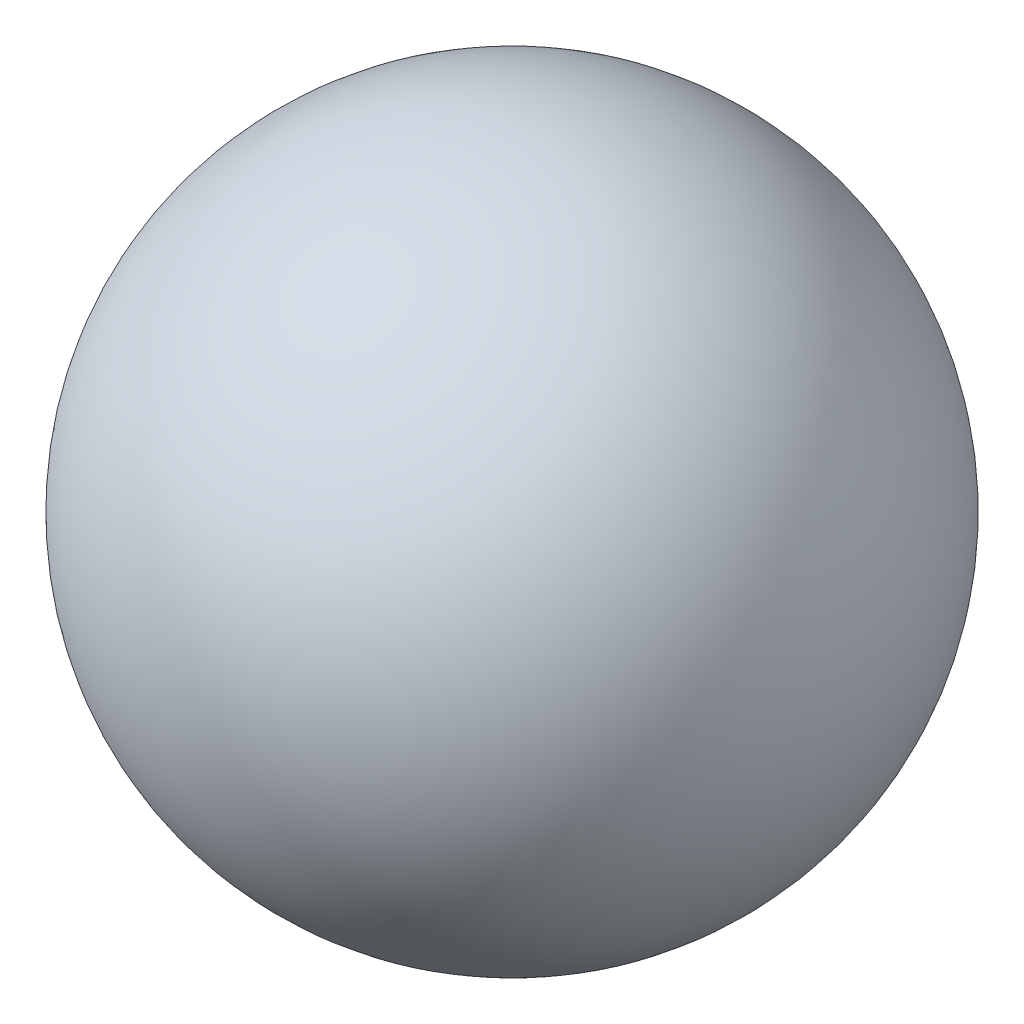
from build123d import *


with BuildPart() as part:
    # Sketch 1 → Revolve 1 (revolve)
    with BuildSketch(Plane.XY):
        with BuildLine():
            Line((0, 2.49), (0, -2.49))
            ThreePointArc((0, -2.49), (-2.49, 0), (0, 2.49))
        make_face()
    revolve(axis=Axis((0, 2.49, 0), (0, -1, 0)))


solid = part.part
